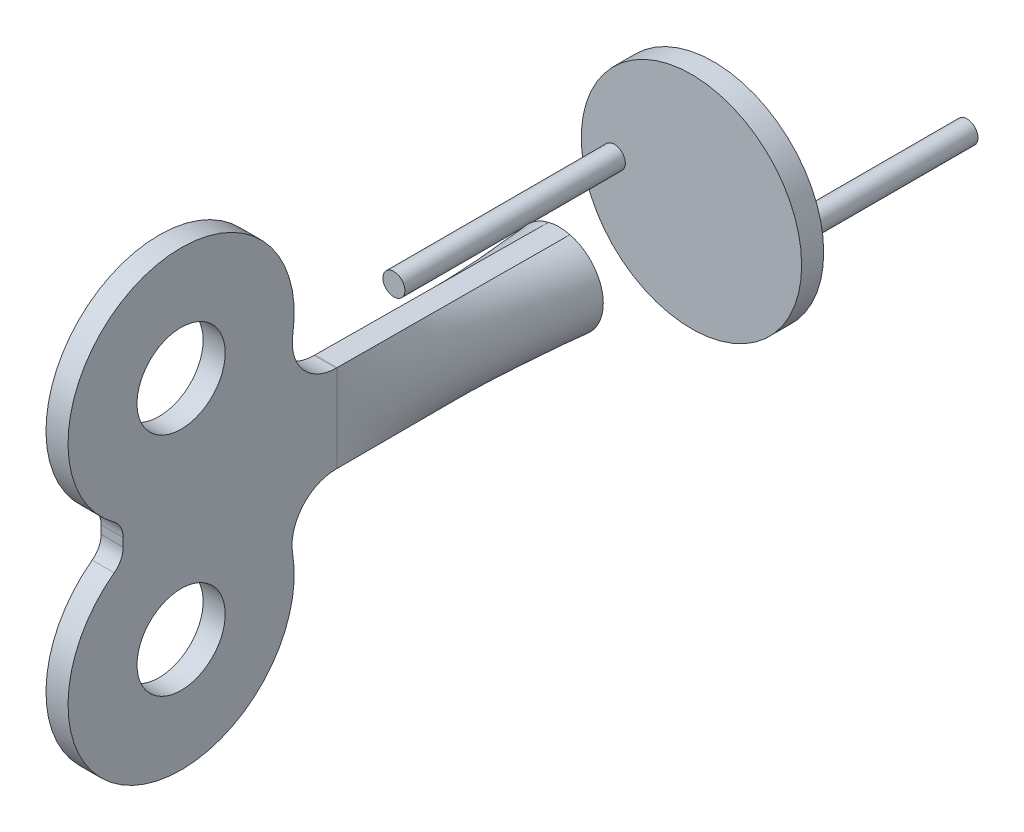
ISO-10303-21;
HEADER;
FILE_DESCRIPTION(('STEP AP214'),'2;1');
FILE_NAME('part.step','',(''),(''),'','','');
FILE_SCHEMA(('AUTOMOTIVE_DESIGN { 1 0 10303 214 1 1 1 1 }'));
ENDSEC;
DATA;
#1=APPLICATION_CONTEXT('core data for automotive mechanical design processes');
#2=APPLICATION_PROTOCOL_DEFINITION('international standard','automotive_design',2000,#1);
#3=PRODUCT_CONTEXT('',#1,'mechanical');
#4=PRODUCT('Part','Part','',(#3));
#5=PRODUCT_RELATED_PRODUCT_CATEGORY('part','',(#4));
#6=PRODUCT_DEFINITION_FORMATION('','',#4);
#7=PRODUCT_DEFINITION_CONTEXT('part definition',#1,'design');
#8=PRODUCT_DEFINITION('design','',#6,#7);
#9=PRODUCT_DEFINITION_SHAPE('','',#8);
#10=(LENGTH_UNIT() NAMED_UNIT(*) SI_UNIT(.MILLI.,.METRE.));
#11=(NAMED_UNIT(*) PLANE_ANGLE_UNIT() SI_UNIT($,.RADIAN.));
#12=(NAMED_UNIT(*) SI_UNIT($,.STERADIAN.) SOLID_ANGLE_UNIT());
#13=UNCERTAINTY_MEASURE_WITH_UNIT(LENGTH_MEASURE(1.E-05),#10,'distance_accuracy_value','');
#14=(GEOMETRIC_REPRESENTATION_CONTEXT(3) GLOBAL_UNCERTAINTY_ASSIGNED_CONTEXT((#13)) GLOBAL_UNIT_ASSIGNED_CONTEXT((#10,
#11,#12)) REPRESENTATION_CONTEXT('',''));
#15=CARTESIAN_POINT('',(0.,0.,0.));
#16=DIRECTION('',(0.,0.,1.));
#17=DIRECTION('',(1.,0.,0.));
#18=AXIS2_PLACEMENT_3D('',#15,#16,#17);
#19=CARTESIAN_POINT('',(0.,0.,-5.99999999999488));
#20=DIRECTION('',(0.,0.,1.));
#21=DIRECTION('',(1.,0.,0.));
#22=AXIS2_PLACEMENT_3D('',#19,#20,#21);
#23=PLANE('',#22);
#24=CARTESIAN_POINT('',(0.,0.,-5.99999999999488));
#25=DIRECTION('',(0.,0.,1.));
#26=DIRECTION('',(1.,0.,0.));
#27=AXIS2_PLACEMENT_3D('',#24,#25,#26);
#28=CIRCLE('',#27,5.);
#29=CARTESIAN_POINT('',(5.,0.,-5.99999999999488));
#30=VERTEX_POINT('',#29);
#31=EDGE_CURVE('E73',#30,#30,#28,.T.);
#32=ORIENTED_EDGE('',*,*,#31,.T.);
#33=EDGE_LOOP('',(#32));
#34=FACE_BOUND('',#33,.T.);
#35=CARTESIAN_POINT('',(-3.5,0.,-5.99999999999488));
#36=DIRECTION('',(0.,0.,1.));
#37=DIRECTION('',(1.,0.,0.));
#38=AXIS2_PLACEMENT_3D('',#35,#36,#37);
#39=CIRCLE('',#38,0.500000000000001);
#40=CARTESIAN_POINT('',(-3.,0.,-5.99999999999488));
#41=VERTEX_POINT('',#40);
#42=EDGE_CURVE('E82',#41,#41,#39,.T.);
#43=ORIENTED_EDGE('',*,*,#42,.F.);
#44=EDGE_LOOP('',(#43));
#45=FACE_BOUND('',#44,.T.);
#46=ADVANCED_FACE('F65',(#34,#45),#23,.T.);
#47=CARTESIAN_POINT('',(0.,0.,-6.99999999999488));
#48=DIRECTION('',(0.,0.,1.));
#49=DIRECTION('',(1.,0.,0.));
#50=AXIS2_PLACEMENT_3D('',#47,#48,#49);
#51=CYLINDRICAL_SURFACE('',#50,5.);
#52=CARTESIAN_POINT('',(0.,0.,-6.99999999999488));
#53=DIRECTION('',(0.,0.,1.));
#54=DIRECTION('',(1.,0.,0.));
#55=AXIS2_PLACEMENT_3D('',#52,#53,#54);
#56=CIRCLE('',#55,5.);
#57=CARTESIAN_POINT('',(5.,0.,-6.99999999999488));
#58=VERTEX_POINT('',#57);
#59=EDGE_CURVE('E12',#58,#58,#56,.T.);
#60=ORIENTED_EDGE('',*,*,#59,.T.);
#61=EDGE_LOOP('',(#60));
#62=FACE_BOUND('',#61,.T.);
#63=ORIENTED_EDGE('',*,*,#31,.F.);
#64=EDGE_LOOP('',(#63));
#65=FACE_BOUND('',#64,.T.);
#66=ADVANCED_FACE('F67',(#62,#65),#51,.T.);
#67=CARTESIAN_POINT('',(0.,0.,-6.99999999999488));
#68=DIRECTION('',(0.,0.,1.));
#69=DIRECTION('',(1.,0.,0.));
#70=AXIS2_PLACEMENT_3D('',#67,#68,#69);
#71=PLANE('',#70);
#72=CARTESIAN_POINT('',(3.5,0.,-6.99999999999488));
#73=DIRECTION('',(0.,0.,1.));
#74=DIRECTION('',(1.,0.,0.));
#75=AXIS2_PLACEMENT_3D('',#72,#73,#74);
#76=CIRCLE('',#75,0.500000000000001);
#77=CARTESIAN_POINT('',(4.,0.,-6.99999999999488));
#78=VERTEX_POINT('',#77);
#79=EDGE_CURVE('E69',#78,#78,#76,.T.);
#80=ORIENTED_EDGE('',*,*,#79,.T.);
#81=EDGE_LOOP('',(#80));
#82=FACE_BOUND('',#81,.T.);
#83=ORIENTED_EDGE('',*,*,#59,.F.);
#84=EDGE_LOOP('',(#83));
#85=FACE_BOUND('',#84,.T.);
#86=ADVANCED_FACE('F92',(#82,#85),#71,.F.);
#87=CARTESIAN_POINT('',(-3.5,0.,4.00000000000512));
#88=DIRECTION('',(0.,0.,-1.));
#89=DIRECTION('',(-1.,0.,0.));
#90=AXIS2_PLACEMENT_3D('',#87,#88,#89);
#91=CYLINDRICAL_SURFACE('',#90,0.500000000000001);
#92=CARTESIAN_POINT('',(-3.5,0.,4.00000000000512));
#93=DIRECTION('',(0.,0.,1.));
#94=DIRECTION('',(1.,0.,0.));
#95=AXIS2_PLACEMENT_3D('',#92,#93,#94);
#96=CIRCLE('',#95,0.500000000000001);
#97=CARTESIAN_POINT('',(-3.,0.,4.00000000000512));
#98=VERTEX_POINT('',#97);
#99=EDGE_CURVE('E77',#98,#98,#96,.T.);
#100=ORIENTED_EDGE('',*,*,#99,.F.);
#101=EDGE_LOOP('',(#100));
#102=FACE_BOUND('',#101,.T.);
#103=ORIENTED_EDGE('',*,*,#42,.T.);
#104=EDGE_LOOP('',(#103));
#105=FACE_BOUND('',#104,.T.);
#106=ADVANCED_FACE('F108',(#102,#105),#91,.T.);
#107=CARTESIAN_POINT('',(-3.5,0.,4.00000000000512));
#108=DIRECTION('',(0.,0.,1.));
#109=DIRECTION('',(1.,0.,0.));
#110=AXIS2_PLACEMENT_3D('',#107,#108,#109);
#111=PLANE('',#110);
#112=ORIENTED_EDGE('',*,*,#99,.T.);
#113=EDGE_LOOP('',(#112));
#114=FACE_BOUND('',#113,.T.);
#115=ADVANCED_FACE('F98',(#114),#111,.T.);
#116=CARTESIAN_POINT('',(3.5,0.,-14.9999999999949));
#117=DIRECTION('',(0.,0.,1.));
#118=DIRECTION('',(1.,0.,0.));
#119=AXIS2_PLACEMENT_3D('',#116,#117,#118);
#120=CYLINDRICAL_SURFACE('',#119,0.500000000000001);
#121=CARTESIAN_POINT('',(3.5,0.,-14.9999999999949));
#122=DIRECTION('',(0.,0.,1.));
#123=DIRECTION('',(1.,0.,0.));
#124=AXIS2_PLACEMENT_3D('',#121,#122,#123);
#125=CIRCLE('',#124,0.500000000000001);
#126=CARTESIAN_POINT('',(4.,0.,-14.9999999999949));
#127=VERTEX_POINT('',#126);
#128=EDGE_CURVE('E85',#127,#127,#125,.T.);
#129=ORIENTED_EDGE('',*,*,#128,.T.);
#130=EDGE_LOOP('',(#129));
#131=FACE_BOUND('',#130,.T.);
#132=ORIENTED_EDGE('',*,*,#79,.F.);
#133=EDGE_LOOP('',(#132));
#134=FACE_BOUND('',#133,.T.);
#135=ADVANCED_FACE('F95',(#131,#134),#120,.T.);
#136=CARTESIAN_POINT('',(3.5,0.,-14.9999999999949));
#137=DIRECTION('',(0.,0.,1.));
#138=DIRECTION('',(1.,0.,0.));
#139=AXIS2_PLACEMENT_3D('',#136,#137,#138);
#140=PLANE('',#139);
#141=ORIENTED_EDGE('',*,*,#128,.F.);
#142=EDGE_LOOP('',(#141));
#143=FACE_BOUND('',#142,.T.);
#144=ADVANCED_FACE('F97',(#143),#140,.F.);
#145=CLOSED_SHELL('',(#46,#66,#86,#106,#115,#135,#144));
#146=MANIFOLD_SOLID_BREP('B2',#145);
#147=CARTESIAN_POINT('',(0.5,0.188903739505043,21.28197666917));
#148=DIRECTION('',(-1.,0.,0.));
#149=DIRECTION('',(0.,0.,1.));
#150=AXIS2_PLACEMENT_3D('',#147,#148,#149);
#151=PLANE('',#150);
#152=CARTESIAN_POINT('',(0.5,5.13070611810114,17.6537337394));
#153=DIRECTION('',(1.,0.,0.));
#154=DIRECTION('',(0.,0.,-1.));
#155=AXIS2_PLACEMENT_3D('',#152,#153,#154);
#156=CIRCLE('',#155,2.);
#157=CARTESIAN_POINT('',(0.5,5.13070611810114,15.6537337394));
#158=VERTEX_POINT('',#157);
#159=EDGE_CURVE('E301',#158,#158,#156,.T.);
#160=ORIENTED_EDGE('',*,*,#159,.F.);
#161=EDGE_LOOP('',(#160));
#162=FACE_BOUND('',#161,.T.);
#163=CARTESIAN_POINT('',(0.5,0.188903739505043,21.28197666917));
#164=DIRECTION('',(-1.,0.,0.));
#165=DIRECTION('',(0.,0.,1.));
#166=AXIS2_PLACEMENT_3D('',#163,#164,#165);
#167=CIRCLE('',#166,1.);
#168=CARTESIAN_POINT('',(0.5,0.994977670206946,20.6901618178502));
#169=VERTEX_POINT('',#168);
#170=CARTESIAN_POINT('',(0.5,0.188903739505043,20.28197666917));
#171=VERTEX_POINT('',#170);
#172=EDGE_CURVE('E304',#169,#171,#167,.T.);
#173=ORIENTED_EDGE('',*,*,#172,.T.);
#174=DIRECTION('',(0.,-1.,0.));
#175=VECTOR('',#174,1.);
#176=CARTESIAN_POINT('',(0.5,0.188903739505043,20.28197666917));
#177=LINE('',#176,#175);
#178=CARTESIAN_POINT('',(0.5,-0.188903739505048,20.28197666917));
#179=VERTEX_POINT('',#178);
#180=EDGE_CURVE('E306',#171,#179,#177,.T.);
#181=ORIENTED_EDGE('',*,*,#180,.T.);
#182=CARTESIAN_POINT('',(0.5,-0.188903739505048,21.28197666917));
#183=DIRECTION('',(-1.,0.,0.));
#184=DIRECTION('',(0.,0.,-1.));
#185=AXIS2_PLACEMENT_3D('',#182,#183,#184);
#186=CIRCLE('',#185,1.);
#187=CARTESIAN_POINT('',(0.5,-0.99497767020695,20.6901618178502));
#188=VERTEX_POINT('',#187);
#189=EDGE_CURVE('E308',#179,#188,#186,.T.);
#190=ORIENTED_EDGE('',*,*,#189,.T.);
#191=CARTESIAN_POINT('',(0.5,-5.13070611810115,17.6537337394));
#192=DIRECTION('',(1.,0.,0.));
#193=DIRECTION('',(0.,0.,1.));
#194=AXIS2_PLACEMENT_3D('',#191,#192,#193);
#195=CIRCLE('',#194,5.13070611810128);
#196=CARTESIAN_POINT('',(0.5,-4.28245071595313,12.5936341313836));
#197=VERTEX_POINT('',#196);
#198=EDGE_CURVE('E310',#188,#197,#195,.T.);
#199=ORIENTED_EDGE('',*,*,#198,.T.);
#200=CARTESIAN_POINT('',(0.5,-3.95179236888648,10.6211572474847));
#201=DIRECTION('',(-1.,0.,0.));
#202=DIRECTION('',(0.,0.,1.));
#203=AXIS2_PLACEMENT_3D('',#200,#201,#202);
#204=CIRCLE('',#203,2.00000000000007);
#205=CARTESIAN_POINT('',(0.5,-1.95179236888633,10.6211572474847));
#206=VERTEX_POINT('',#205);
#207=EDGE_CURVE('E312',#197,#206,#204,.T.);
#208=ORIENTED_EDGE('',*,*,#207,.T.);
#209=DIRECTION('',(0.,0.,-1.));
#210=VECTOR('',#209,1.);
#211=CARTESIAN_POINT('',(0.5,-1.95179236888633,10.579531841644));
#212=LINE('',#211,#210);
#213=CARTESIAN_POINT('',(0.5,-1.95179236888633,10.579531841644));
#214=VERTEX_POINT('',#213);
#215=EDGE_CURVE('E314',#206,#214,#212,.T.);
#216=ORIENTED_EDGE('',*,*,#215,.T.);
#217=DIRECTION('',(0.,1.,0.));
#218=VECTOR('',#217,1.);
#219=CARTESIAN_POINT('',(0.5,2.01346111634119,10.579531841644));
#220=LINE('',#219,#218);
#221=CARTESIAN_POINT('',(0.5,2.01346111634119,10.579531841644));
#222=VERTEX_POINT('',#221);
#223=EDGE_CURVE('E317',#214,#222,#220,.T.);
#224=ORIENTED_EDGE('',*,*,#223,.T.);
#225=DIRECTION('',(0.,0.00489820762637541,0.999988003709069));
#226=VECTOR('',#225,1.);
#227=CARTESIAN_POINT('',(0.5,2.01366357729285,10.620865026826));
#228=LINE('',#227,#226);
#229=CARTESIAN_POINT('',(0.5,2.01366357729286,10.620865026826));
#230=VERTEX_POINT('',#229);
#231=EDGE_CURVE('E281',#222,#230,#228,.T.);
#232=ORIENTED_EDGE('',*,*,#231,.T.);
#233=CARTESIAN_POINT('',(0.5,4.01363958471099,10.6110686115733));
#234=DIRECTION('',(-1.,0.,0.));
#235=DIRECTION('',(0.,0.,-1.));
#236=AXIS2_PLACEMENT_3D('',#233,#234,#235);
#237=CIRCLE('',#236,2.);
#238=CARTESIAN_POINT('',(0.5,4.32695120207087,12.5863751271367));
#239=VERTEX_POINT('',#238);
#240=EDGE_CURVE('E182',#230,#239,#237,.T.);
#241=ORIENTED_EDGE('',*,*,#240,.T.);
#242=CARTESIAN_POINT('',(0.5,5.13070611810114,17.6537337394));
#243=DIRECTION('',(1.,0.,0.));
#244=DIRECTION('',(0.,0.,-1.));
#245=AXIS2_PLACEMENT_3D('',#242,#243,#244);
#246=CIRCLE('',#245,5.13070611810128);
#247=EDGE_CURVE('E177',#239,#169,#246,.T.);
#248=ORIENTED_EDGE('',*,*,#247,.T.);
#249=EDGE_LOOP('',(#173,#181,#190,#199,#208,#216,#224,#232,#241,#248));
#250=FACE_BOUND('',#249,.T.);
#251=CARTESIAN_POINT('',(0.5,-5.13070611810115,17.6537337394));
#252=DIRECTION('',(1.,0.,0.));
#253=DIRECTION('',(0.,0.,1.));
#254=AXIS2_PLACEMENT_3D('',#251,#252,#253);
#255=CIRCLE('',#254,2.);
#256=CARTESIAN_POINT('',(0.5,-5.13070611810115,19.6537337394));
#257=VERTEX_POINT('',#256);
#258=EDGE_CURVE('E298',#257,#257,#255,.T.);
#259=ORIENTED_EDGE('',*,*,#258,.F.);
#260=EDGE_LOOP('',(#259));
#261=FACE_BOUND('',#260,.T.);
#262=ADVANCED_FACE('F162',(#162,#250,#261),#151,.F.);
#263=CARTESIAN_POINT('',(0.5,0.188903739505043,21.28197666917));
#264=DIRECTION('',(-1.,0.,0.));
#265=DIRECTION('',(0.,0.,1.));
#266=AXIS2_PLACEMENT_3D('',#263,#264,#265);
#267=CYLINDRICAL_SURFACE('',#266,1.);
#268=DIRECTION('',(-1.,0.,0.));
#269=VECTOR('',#268,1.);
#270=CARTESIAN_POINT('',(0.5,0.994977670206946,20.6901618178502));
#271=LINE('',#270,#269);
#272=CARTESIAN_POINT('',(-0.5,0.994977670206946,20.6901618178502));
#273=VERTEX_POINT('',#272);
#274=EDGE_CURVE('E323',#169,#273,#271,.T.);
#275=ORIENTED_EDGE('',*,*,#274,.T.);
#276=CARTESIAN_POINT('',(-0.5,0.188903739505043,21.28197666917));
#277=DIRECTION('',(-1.,0.,0.));
#278=DIRECTION('',(0.,0.,1.));
#279=AXIS2_PLACEMENT_3D('',#276,#277,#278);
#280=CIRCLE('',#279,1.);
#281=CARTESIAN_POINT('',(-0.5,0.188903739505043,20.28197666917));
#282=VERTEX_POINT('',#281);
#283=EDGE_CURVE('E354',#273,#282,#280,.T.);
#284=ORIENTED_EDGE('',*,*,#283,.T.);
#285=DIRECTION('',(-1.,0.,0.));
#286=VECTOR('',#285,1.);
#287=CARTESIAN_POINT('',(0.5,0.188903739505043,20.28197666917));
#288=LINE('',#287,#286);
#289=EDGE_CURVE('E63',#171,#282,#288,.T.);
#290=ORIENTED_EDGE('',*,*,#289,.F.);
#291=ORIENTED_EDGE('',*,*,#172,.F.);
#292=EDGE_LOOP('',(#275,#284,#290,#291));
#293=FACE_BOUND('',#292,.T.);
#294=ADVANCED_FACE('F164',(#293),#267,.F.);
#295=CARTESIAN_POINT('',(0.5,0.188903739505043,20.28197666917));
#296=DIRECTION('',(0.,0.,-1.));
#297=DIRECTION('',(-1.,0.,0.));
#298=AXIS2_PLACEMENT_3D('',#295,#296,#297);
#299=PLANE('',#298);
#300=ORIENTED_EDGE('',*,*,#289,.T.);
#301=DIRECTION('',(0.,-1.,0.));
#302=VECTOR('',#301,1.);
#303=CARTESIAN_POINT('',(-0.5,0.188903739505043,20.28197666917));
#304=LINE('',#303,#302);
#305=CARTESIAN_POINT('',(-0.5,-0.188903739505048,20.28197666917));
#306=VERTEX_POINT('',#305);
#307=EDGE_CURVE('E346',#282,#306,#304,.T.);
#308=ORIENTED_EDGE('',*,*,#307,.T.);
#309=DIRECTION('',(-1.,0.,0.));
#310=VECTOR('',#309,1.);
#311=CARTESIAN_POINT('',(0.5,-0.188903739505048,20.28197666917));
#312=LINE('',#311,#310);
#313=EDGE_CURVE('E170',#179,#306,#312,.T.);
#314=ORIENTED_EDGE('',*,*,#313,.F.);
#315=ORIENTED_EDGE('',*,*,#180,.F.);
#316=EDGE_LOOP('',(#300,#308,#314,#315));
#317=FACE_BOUND('',#316,.T.);
#318=ADVANCED_FACE('F352',(#317),#299,.F.);
#319=CARTESIAN_POINT('',(0.5,-0.188903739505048,21.28197666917));
#320=DIRECTION('',(-1.,0.,0.));
#321=DIRECTION('',(0.,0.,1.));
#322=AXIS2_PLACEMENT_3D('',#319,#320,#321);
#323=CYLINDRICAL_SURFACE('',#322,1.);
#324=ORIENTED_EDGE('',*,*,#313,.T.);
#325=CARTESIAN_POINT('',(-0.5,-0.188903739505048,21.28197666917));
#326=DIRECTION('',(-1.,0.,0.));
#327=DIRECTION('',(0.,0.,-1.));
#328=AXIS2_PLACEMENT_3D('',#325,#326,#327);
#329=CIRCLE('',#328,1.);
#330=CARTESIAN_POINT('',(-0.5,-0.99497767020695,20.6901618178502));
#331=VERTEX_POINT('',#330);
#332=EDGE_CURVE('E341',#306,#331,#329,.T.);
#333=ORIENTED_EDGE('',*,*,#332,.T.);
#334=DIRECTION('',(-1.,0.,0.));
#335=VECTOR('',#334,1.);
#336=CARTESIAN_POINT('',(0.5,-0.99497767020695,20.6901618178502));
#337=LINE('',#336,#335);
#338=EDGE_CURVE('E333',#188,#331,#337,.T.);
#339=ORIENTED_EDGE('',*,*,#338,.F.);
#340=ORIENTED_EDGE('',*,*,#189,.F.);
#341=EDGE_LOOP('',(#324,#333,#339,#340));
#342=FACE_BOUND('',#341,.T.);
#343=ADVANCED_FACE('F339',(#342),#323,.F.);
#344=CARTESIAN_POINT('',(0.5,-5.13070611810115,17.6537337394));
#345=DIRECTION('',(-1.,0.,0.));
#346=DIRECTION('',(0.,0.,1.));
#347=AXIS2_PLACEMENT_3D('',#344,#345,#346);
#348=CYLINDRICAL_SURFACE('',#347,5.13070611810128);
#349=ORIENTED_EDGE('',*,*,#338,.T.);
#350=CARTESIAN_POINT('',(-0.5,-5.13070611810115,17.6537337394));
#351=DIRECTION('',(1.,0.,0.));
#352=DIRECTION('',(0.,0.,1.));
#353=AXIS2_PLACEMENT_3D('',#350,#351,#352);
#354=CIRCLE('',#353,5.13070611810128);
#355=CARTESIAN_POINT('',(-0.5,-4.28245071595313,12.5936341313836));
#356=VERTEX_POINT('',#355);
#357=EDGE_CURVE('E350',#331,#356,#354,.T.);
#358=ORIENTED_EDGE('',*,*,#357,.T.);
#359=DIRECTION('',(-1.,0.,0.));
#360=VECTOR('',#359,1.);
#361=CARTESIAN_POINT('',(0.5,-4.28245071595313,12.5936341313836));
#362=LINE('',#361,#360);
#363=EDGE_CURVE('E331',#197,#356,#362,.T.);
#364=ORIENTED_EDGE('',*,*,#363,.F.);
#365=ORIENTED_EDGE('',*,*,#198,.F.);
#366=EDGE_LOOP('',(#349,#358,#364,#365));
#367=FACE_BOUND('',#366,.T.);
#368=ADVANCED_FACE('F374',(#367),#348,.T.);
#369=CARTESIAN_POINT('',(0.5,-3.95179236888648,10.6211572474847));
#370=DIRECTION('',(-1.,0.,0.));
#371=DIRECTION('',(0.,0.,1.));
#372=AXIS2_PLACEMENT_3D('',#369,#370,#371);
#373=CYLINDRICAL_SURFACE('',#372,2.00000000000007);
#374=ORIENTED_EDGE('',*,*,#363,.T.);
#375=CARTESIAN_POINT('',(-0.5,-3.95179236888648,10.6211572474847));
#376=DIRECTION('',(-1.,0.,0.));
#377=DIRECTION('',(0.,0.,1.));
#378=AXIS2_PLACEMENT_3D('',#375,#376,#377);
#379=CIRCLE('',#378,2.00000000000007);
#380=CARTESIAN_POINT('',(-0.5,-1.95179236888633,10.6211572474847));
#381=VERTEX_POINT('',#380);
#382=EDGE_CURVE('E361',#356,#381,#379,.T.);
#383=ORIENTED_EDGE('',*,*,#382,.T.);
#384=DIRECTION('',(-1.,0.,0.));
#385=VECTOR('',#384,1.);
#386=CARTESIAN_POINT('',(0.5,-1.95179236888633,10.6211572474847));
#387=LINE('',#386,#385);
#388=EDGE_CURVE('E329',#206,#381,#387,.T.);
#389=ORIENTED_EDGE('',*,*,#388,.F.);
#390=ORIENTED_EDGE('',*,*,#207,.F.);
#391=EDGE_LOOP('',(#374,#383,#389,#390));
#392=FACE_BOUND('',#391,.T.);
#393=ADVANCED_FACE('F369',(#392),#373,.F.);
#394=CARTESIAN_POINT('',(0.5,-1.95179236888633,10.579531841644));
#395=DIRECTION('',(0.,1.,0.));
#396=DIRECTION('',(0.,0.,1.));
#397=AXIS2_PLACEMENT_3D('',#394,#395,#396);
#398=PLANE('',#397);
#399=ORIENTED_EDGE('',*,*,#388,.T.);
#400=DIRECTION('',(0.,0.,-1.));
#401=VECTOR('',#400,1.);
#402=CARTESIAN_POINT('',(-0.5,-1.95179236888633,10.579531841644));
#403=LINE('',#402,#401);
#404=CARTESIAN_POINT('',(-0.5,-1.95179236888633,10.579531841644));
#405=VERTEX_POINT('',#404);
#406=EDGE_CURVE('E262',#381,#405,#403,.T.);
#407=ORIENTED_EDGE('',*,*,#406,.T.);
#408=DIRECTION('',(-1.,0.,0.));
#409=VECTOR('',#408,1.);
#410=CARTESIAN_POINT('',(0.5,-1.95179236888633,10.579531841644));
#411=LINE('',#410,#409);
#412=EDGE_CURVE('E282',#214,#405,#411,.T.);
#413=ORIENTED_EDGE('',*,*,#412,.F.);
#414=ORIENTED_EDGE('',*,*,#215,.F.);
#415=EDGE_LOOP('',(#399,#407,#413,#414));
#416=FACE_BOUND('',#415,.T.);
#417=ADVANCED_FACE('F365',(#416),#398,.F.);
#418=CARTESIAN_POINT('',(0.5,2.01366357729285,10.620865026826));
#419=DIRECTION('',(0.,-0.999988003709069,0.00489820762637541));
#420=DIRECTION('',(0.,-0.00489820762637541,-0.999988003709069));
#421=AXIS2_PLACEMENT_3D('',#418,#419,#420);
#422=PLANE('',#421);
#423=DIRECTION('',(-1.,0.,0.));
#424=VECTOR('',#423,1.);
#425=CARTESIAN_POINT('',(0.5,2.01346111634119,10.579531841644));
#426=LINE('',#425,#424);
#427=CARTESIAN_POINT('',(-0.5,2.01346111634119,10.579531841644));
#428=VERTEX_POINT('',#427);
#429=EDGE_CURVE('E268',#222,#428,#426,.T.);
#430=ORIENTED_EDGE('',*,*,#429,.T.);
#431=DIRECTION('',(0.,0.00489820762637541,0.999988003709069));
#432=VECTOR('',#431,1.);
#433=CARTESIAN_POINT('',(-0.5,2.01366357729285,10.620865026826));
#434=LINE('',#433,#432);
#435=CARTESIAN_POINT('',(-0.5,2.01366357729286,10.620865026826));
#436=VERTEX_POINT('',#435);
#437=EDGE_CURVE('E261',#428,#436,#434,.T.);
#438=ORIENTED_EDGE('',*,*,#437,.T.);
#439=DIRECTION('',(-1.,0.,0.));
#440=VECTOR('',#439,1.);
#441=CARTESIAN_POINT('',(0.5,2.01366357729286,10.620865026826));
#442=LINE('',#441,#440);
#443=EDGE_CURVE('E283',#230,#436,#442,.T.);
#444=ORIENTED_EDGE('',*,*,#443,.F.);
#445=ORIENTED_EDGE('',*,*,#231,.F.);
#446=EDGE_LOOP('',(#430,#438,#444,#445));
#447=FACE_BOUND('',#446,.T.);
#448=ADVANCED_FACE('F279',(#447),#422,.F.);
#449=CARTESIAN_POINT('',(0.5,4.01363958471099,10.6110686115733));
#450=DIRECTION('',(-1.,0.,0.));
#451=DIRECTION('',(0.,0.,1.));
#452=AXIS2_PLACEMENT_3D('',#449,#450,#451);
#453=CYLINDRICAL_SURFACE('',#452,2.);
#454=ORIENTED_EDGE('',*,*,#443,.T.);
#455=CARTESIAN_POINT('',(-0.5,4.01363958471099,10.6110686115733));
#456=DIRECTION('',(-1.,0.,0.));
#457=DIRECTION('',(0.,0.,-1.));
#458=AXIS2_PLACEMENT_3D('',#455,#456,#457);
#459=CIRCLE('',#458,2.);
#460=CARTESIAN_POINT('',(-0.5,4.32695120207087,12.5863751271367));
#461=VERTEX_POINT('',#460);
#462=EDGE_CURVE('E290',#436,#461,#459,.T.);
#463=ORIENTED_EDGE('',*,*,#462,.T.);
#464=DIRECTION('',(-1.,0.,0.));
#465=VECTOR('',#464,1.);
#466=CARTESIAN_POINT('',(0.5,4.32695120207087,12.5863751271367));
#467=LINE('',#466,#465);
#468=EDGE_CURVE('E325',#239,#461,#467,.T.);
#469=ORIENTED_EDGE('',*,*,#468,.F.);
#470=ORIENTED_EDGE('',*,*,#240,.F.);
#471=EDGE_LOOP('',(#454,#463,#469,#470));
#472=FACE_BOUND('',#471,.T.);
#473=ADVANCED_FACE('F381',(#472),#453,.F.);
#474=CARTESIAN_POINT('',(0.5,5.13070611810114,17.6537337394));
#475=DIRECTION('',(-1.,0.,0.));
#476=DIRECTION('',(0.,0.,1.));
#477=AXIS2_PLACEMENT_3D('',#474,#475,#476);
#478=CYLINDRICAL_SURFACE('',#477,5.13070611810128);
#479=ORIENTED_EDGE('',*,*,#468,.T.);
#480=CARTESIAN_POINT('',(-0.5,5.13070611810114,17.6537337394));
#481=DIRECTION('',(1.,0.,0.));
#482=DIRECTION('',(0.,0.,-1.));
#483=AXIS2_PLACEMENT_3D('',#480,#481,#482);
#484=CIRCLE('',#483,5.13070611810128);
#485=EDGE_CURVE('E292',#461,#273,#484,.T.);
#486=ORIENTED_EDGE('',*,*,#485,.T.);
#487=ORIENTED_EDGE('',*,*,#274,.F.);
#488=ORIENTED_EDGE('',*,*,#247,.F.);
#489=EDGE_LOOP('',(#479,#486,#487,#488));
#490=FACE_BOUND('',#489,.T.);
#491=ADVANCED_FACE('F379',(#490),#478,.T.);
#492=CARTESIAN_POINT('',(0.5,5.13070611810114,17.6537337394));
#493=DIRECTION('',(-1.,0.,0.));
#494=DIRECTION('',(0.,0.,1.));
#495=AXIS2_PLACEMENT_3D('',#492,#493,#494);
#496=CYLINDRICAL_SURFACE('',#495,2.);
#497=ORIENTED_EDGE('',*,*,#159,.T.);
#498=EDGE_LOOP('',(#497));
#499=FACE_BOUND('',#498,.T.);
#500=CARTESIAN_POINT('',(-0.5,5.13070611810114,17.6537337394));
#501=DIRECTION('',(1.,0.,0.));
#502=DIRECTION('',(0.,0.,-1.));
#503=AXIS2_PLACEMENT_3D('',#500,#501,#502);
#504=CIRCLE('',#503,2.);
#505=CARTESIAN_POINT('',(-0.5,5.13070611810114,15.6537337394));
#506=VERTEX_POINT('',#505);
#507=EDGE_CURVE('E356',#506,#506,#504,.T.);
#508=ORIENTED_EDGE('',*,*,#507,.F.);
#509=EDGE_LOOP('',(#508));
#510=FACE_BOUND('',#509,.T.);
#511=ADVANCED_FACE('F389',(#499,#510),#496,.F.);
#512=CARTESIAN_POINT('',(0.5,-5.13070611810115,17.6537337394));
#513=DIRECTION('',(-1.,0.,0.));
#514=DIRECTION('',(0.,0.,1.));
#515=AXIS2_PLACEMENT_3D('',#512,#513,#514);
#516=CYLINDRICAL_SURFACE('',#515,2.);
#517=ORIENTED_EDGE('',*,*,#258,.T.);
#518=EDGE_LOOP('',(#517));
#519=FACE_BOUND('',#518,.T.);
#520=CARTESIAN_POINT('',(-0.5,-5.13070611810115,17.6537337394));
#521=DIRECTION('',(1.,0.,0.));
#522=DIRECTION('',(0.,0.,1.));
#523=AXIS2_PLACEMENT_3D('',#520,#521,#522);
#524=CIRCLE('',#523,2.);
#525=CARTESIAN_POINT('',(-0.5,-5.13070611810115,19.6537337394));
#526=VERTEX_POINT('',#525);
#527=EDGE_CURVE('E462',#526,#526,#524,.T.);
#528=ORIENTED_EDGE('',*,*,#527,.F.);
#529=EDGE_LOOP('',(#528));
#530=FACE_BOUND('',#529,.T.);
#531=ADVANCED_FACE('F404',(#519,#530),#516,.F.);
#532=CARTESIAN_POINT('',(-0.5,0.188903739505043,21.28197666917));
#533=DIRECTION('',(-1.,0.,0.));
#534=DIRECTION('',(0.,0.,1.));
#535=AXIS2_PLACEMENT_3D('',#532,#533,#534);
#536=PLANE('',#535);
#537=ORIENTED_EDGE('',*,*,#527,.T.);
#538=EDGE_LOOP('',(#537));
#539=FACE_BOUND('',#538,.T.);
#540=ORIENTED_EDGE('',*,*,#507,.T.);
#541=EDGE_LOOP('',(#540));
#542=FACE_BOUND('',#541,.T.);
#543=ORIENTED_EDGE('',*,*,#283,.F.);
#544=ORIENTED_EDGE('',*,*,#485,.F.);
#545=ORIENTED_EDGE('',*,*,#462,.F.);
#546=ORIENTED_EDGE('',*,*,#437,.F.);
#547=DIRECTION('',(0.,1.,0.));
#548=VECTOR('',#547,1.);
#549=CARTESIAN_POINT('',(-0.5,2.01346111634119,10.579531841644));
#550=LINE('',#549,#548);
#551=EDGE_CURVE('E250',#405,#428,#550,.T.);
#552=ORIENTED_EDGE('',*,*,#551,.F.);
#553=ORIENTED_EDGE('',*,*,#406,.F.);
#554=ORIENTED_EDGE('',*,*,#382,.F.);
#555=ORIENTED_EDGE('',*,*,#357,.F.);
#556=ORIENTED_EDGE('',*,*,#332,.F.);
#557=ORIENTED_EDGE('',*,*,#307,.F.);
#558=EDGE_LOOP('',(#543,#544,#545,#546,#552,#553,#554,#555,#556,#557));
#559=FACE_BOUND('',#558,.T.);
#560=ADVANCED_FACE('F287',(#539,#542,#559),#536,.T.);
#561=CARTESIAN_POINT('',(0.,0.,0.));
#562=DIRECTION('',(0.,0.,1.));
#563=DIRECTION('',(1.,0.,0.));
#564=AXIS2_PLACEMENT_3D('',#561,#562,#563);
#565=PLANE('',#564);
#566=CARTESIAN_POINT('',(0.,0.,0.));
#567=DIRECTION('',(0.,0.,1.));
#568=DIRECTION('',(1.,0.,0.));
#569=AXIS2_PLACEMENT_3D('',#566,#567,#568);
#570=CIRCLE('',#569,2.);
#571=CARTESIAN_POINT('',(0.489068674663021,1.93928126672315,0.));
#572=VERTEX_POINT('',#571);
#573=CARTESIAN_POINT('',(-0.489068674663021,1.93928126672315,0.));
#574=VERTEX_POINT('',#573);
#575=EDGE_CURVE('E270',#572,#574,#570,.T.);
#576=ORIENTED_EDGE('',*,*,#575,.F.);
#577=CARTESIAN_POINT('',(0.489068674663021,-1.93928126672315,0.));
#578=VERTEX_POINT('',#577);
#579=EDGE_CURVE('E273',#578,#572,#570,.T.);
#580=ORIENTED_EDGE('',*,*,#579,.F.);
#581=CARTESIAN_POINT('',(-0.489068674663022,-1.93928126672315,0.));
#582=VERTEX_POINT('',#581);
#583=EDGE_CURVE('E441',#582,#578,#570,.T.);
#584=ORIENTED_EDGE('',*,*,#583,.F.);
#585=EDGE_CURVE('E449',#574,#582,#570,.T.);
#586=ORIENTED_EDGE('',*,*,#585,.F.);
#587=EDGE_LOOP('',(#576,#580,#584,#586));
#588=FACE_BOUND('',#587,.T.);
#589=ADVANCED_FACE('F411',(#588),#565,.F.);
#590=CARTESIAN_POINT('',(0.489068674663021,1.93928126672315,0.));
#591=CARTESIAN_POINT('',(0.5,2.01346111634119,10.579531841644));
#592=CARTESIAN_POINT('',(0.163163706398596,2.02154248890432,0.));
#593=CARTESIAN_POINT('',(0.166666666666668,2.01346111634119,10.579531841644));
#594=CARTESIAN_POINT('',(-0.162882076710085,2.02154248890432,0.));
#595=CARTESIAN_POINT('',(-0.166666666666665,2.01346111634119,10.579531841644));
#596=CARTESIAN_POINT('',(-0.489068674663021,1.93928126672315,0.));
#597=CARTESIAN_POINT('',(-0.5,2.01346111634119,10.579531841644));
#598=B_SPLINE_SURFACE_WITH_KNOTS('',3,1,((#590,#591),(#592,#593),(#594,#595),(#596,#597)),
.UNSPECIFIED.,.F.,.F.,.F.,(4,4),(2,2),(0.,1.),(0.,1.),.UNSPECIFIED.);
#599=DIRECTION('',(-0.00103322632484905,0.00701146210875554,0.999974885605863));
#600=VECTOR('',#599,1.);
#601=CARTESIAN_POINT('',(-0.49453433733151,1.97637119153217,5.28976592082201));
#602=LINE('',#601,#600);
#603=EDGE_CURVE('E253',#574,#428,#602,.T.);
#604=DIRECTION('',(-0.00103322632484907,-0.00701146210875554,-0.999974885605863));
#605=VECTOR('',#604,1.);
#606=CARTESIAN_POINT('',(0.494534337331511,1.97637119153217,5.28976592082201));
#607=LINE('',#606,#605);
#608=EDGE_CURVE('E274',#222,#572,#607,.T.);
#609=ORIENTED_EDGE('',*,*,#575,.T.);
#610=ORIENTED_EDGE('',*,*,#603,.T.);
#611=ORIENTED_EDGE('',*,*,#429,.F.);
#612=ORIENTED_EDGE('',*,*,#608,.T.);
#613=EDGE_LOOP('',(#609,#610,#611,#612));
#614=FACE_BOUND('',#613,.T.);
#615=ADVANCED_FACE('F266',(#614),#598,.T.);
#616=CARTESIAN_POINT('',(-0.489068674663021,1.93928126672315,0.));
#617=CARTESIAN_POINT('',(-0.5,2.01346111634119,10.579531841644));
#618=CARTESIAN_POINT('',(-0.918020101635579,1.83110371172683,0.));
#619=CARTESIAN_POINT('',(-0.5,1.68217030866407,10.579531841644));
#620=CARTESIAN_POINT('',(-1.81867772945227,1.24042601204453,0.));
#621=CARTESIAN_POINT('',(-0.5,0.917258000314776,10.579531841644));
#622=CARTESIAN_POINT('',(-2.14021237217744,-0.150749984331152,0.));
#623=CARTESIAN_POINT('',(-0.5,-0.060242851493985,10.579531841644));
#624=CARTESIAN_POINT('',(-1.58699951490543,-1.38551163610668,0.));
#625=CARTESIAN_POINT('',(-0.5,-1.05070320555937,10.579531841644));
#626=CARTESIAN_POINT('',(-0.934840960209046,-1.82686164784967,0.));
#627=CARTESIAN_POINT('',(-0.5,-1.60754205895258,10.579531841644));
#628=CARTESIAN_POINT('',(-0.489068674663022,-1.93928126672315,0.));
#629=CARTESIAN_POINT('',(-0.5,-1.95179236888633,10.579531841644));
#630=B_SPLINE_SURFACE_WITH_KNOTS('',3,1,((#616,#617),(#618,#619),(#620,#621),(#622,#623),(#624,
#625),(#626,#627),(#628,#629)),.UNSPECIFIED.,.F.,.F.,.F.,(4,1,1,1,4),(2,2),(0.,
0.250645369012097,0.578711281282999,0.739549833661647,1.),(0.,1.),.UNSPECIFIED.);
#631=DIRECTION('',(-0.00103325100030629,-0.00118257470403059,0.99999876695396));
#632=VECTOR('',#631,1.);
#633=CARTESIAN_POINT('',(-0.494534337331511,-1.94553681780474,5.28976592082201));
#634=LINE('',#633,#632);
#635=EDGE_CURVE('E256',#582,#405,#634,.T.);
#636=ORIENTED_EDGE('',*,*,#585,.T.);
#637=ORIENTED_EDGE('',*,*,#635,.T.);
#638=ORIENTED_EDGE('',*,*,#551,.T.);
#639=ORIENTED_EDGE('',*,*,#603,.F.);
#640=EDGE_LOOP('',(#636,#637,#638,#639));
#641=FACE_BOUND('',#640,.T.);
#642=ADVANCED_FACE('F252',(#641),#630,.T.);
#643=CARTESIAN_POINT('',(0.489068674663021,-1.93928126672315,0.));
#644=CARTESIAN_POINT('',(0.5,-1.95179236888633,10.579531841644));
#645=CARTESIAN_POINT('',(0.918020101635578,-1.83110371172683,0.));
#646=CARTESIAN_POINT('',(0.5,-1.62050156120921,10.579531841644));
#647=CARTESIAN_POINT('',(1.81867772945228,-1.24042601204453,0.));
#648=CARTESIAN_POINT('',(0.5,-0.855589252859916,10.579531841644));
#649=CARTESIAN_POINT('',(2.14021237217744,0.150749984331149,0.));
#650=CARTESIAN_POINT('',(0.5,0.121911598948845,10.579531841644));
#651=CARTESIAN_POINT('',(1.58699951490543,1.38551163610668,0.));
#652=CARTESIAN_POINT('',(0.5,1.11237195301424,10.579531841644));
#653=CARTESIAN_POINT('',(0.934840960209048,1.82686164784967,0.));
#654=CARTESIAN_POINT('',(0.5,1.66921080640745,10.579531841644));
#655=CARTESIAN_POINT('',(0.489068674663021,1.93928126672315,0.));
#656=CARTESIAN_POINT('',(0.5,2.01346111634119,10.579531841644));
#657=B_SPLINE_SURFACE_WITH_KNOTS('',3,1,((#643,#644),(#645,#646),(#647,#648),(#649,#650),(#651,
#652),(#653,#654),(#655,#656)),.UNSPECIFIED.,.F.,.F.,.F.,(4,1,1,1,4),(2,2),(0.,
0.250645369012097,0.578711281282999,0.739549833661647,1.),(0.,1.),.UNSPECIFIED.);
#658=DIRECTION('',(0.00103325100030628,-0.00118257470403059,0.99999876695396));
#659=VECTOR('',#658,1.);
#660=CARTESIAN_POINT('',(0.49453433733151,-1.94553681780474,5.28976592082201));
#661=LINE('',#660,#659);
#662=EDGE_CURVE('E485',#578,#214,#661,.T.);
#663=ORIENTED_EDGE('',*,*,#579,.T.);
#664=ORIENTED_EDGE('',*,*,#608,.F.);
#665=ORIENTED_EDGE('',*,*,#223,.F.);
#666=ORIENTED_EDGE('',*,*,#662,.F.);
#667=EDGE_LOOP('',(#663,#664,#665,#666));
#668=FACE_BOUND('',#667,.T.);
#669=ADVANCED_FACE('F489',(#668),#657,.T.);
#670=CARTESIAN_POINT('',(-0.489068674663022,-1.93928126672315,0.));
#671=CARTESIAN_POINT('',(-0.5,-1.95179236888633,10.579531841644));
#672=CARTESIAN_POINT('',(-0.163163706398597,-2.02154248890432,0.));
#673=CARTESIAN_POINT('',(-0.166666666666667,-1.95179236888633,10.579531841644));
#674=CARTESIAN_POINT('',(0.162882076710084,-2.02154248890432,0.));
#675=CARTESIAN_POINT('',(0.166666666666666,-1.95179236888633,10.579531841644));
#676=CARTESIAN_POINT('',(0.489068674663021,-1.93928126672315,0.));
#677=CARTESIAN_POINT('',(0.5,-1.95179236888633,10.579531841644));
#678=B_SPLINE_SURFACE_WITH_KNOTS('',3,1,((#670,#671),(#672,#673),(#674,#675),(#676,#677)),
.UNSPECIFIED.,.F.,.F.,.F.,(4,4),(2,2),(0.,1.),(0.,1.),.UNSPECIFIED.);
#679=ORIENTED_EDGE('',*,*,#583,.T.);
#680=ORIENTED_EDGE('',*,*,#662,.T.);
#681=ORIENTED_EDGE('',*,*,#412,.T.);
#682=ORIENTED_EDGE('',*,*,#635,.F.);
#683=EDGE_LOOP('',(#679,#680,#681,#682));
#684=FACE_BOUND('',#683,.T.);
#685=ADVANCED_FACE('F416',(#684),#678,.T.);
#686=CLOSED_SHELL('',(#262,#294,#318,#343,#368,#393,#417,#448,#473,#491,#511,#531,#560,#589,
#615,#642,#669,#685));
#687=MANIFOLD_SOLID_BREP('B7',#686);
#688=ADVANCED_BREP_SHAPE_REPRESENTATION('',(#18,#146,#687),#14);
#689=SHAPE_DEFINITION_REPRESENTATION(#9,#688);
ENDSEC;
END-ISO-10303-21;
